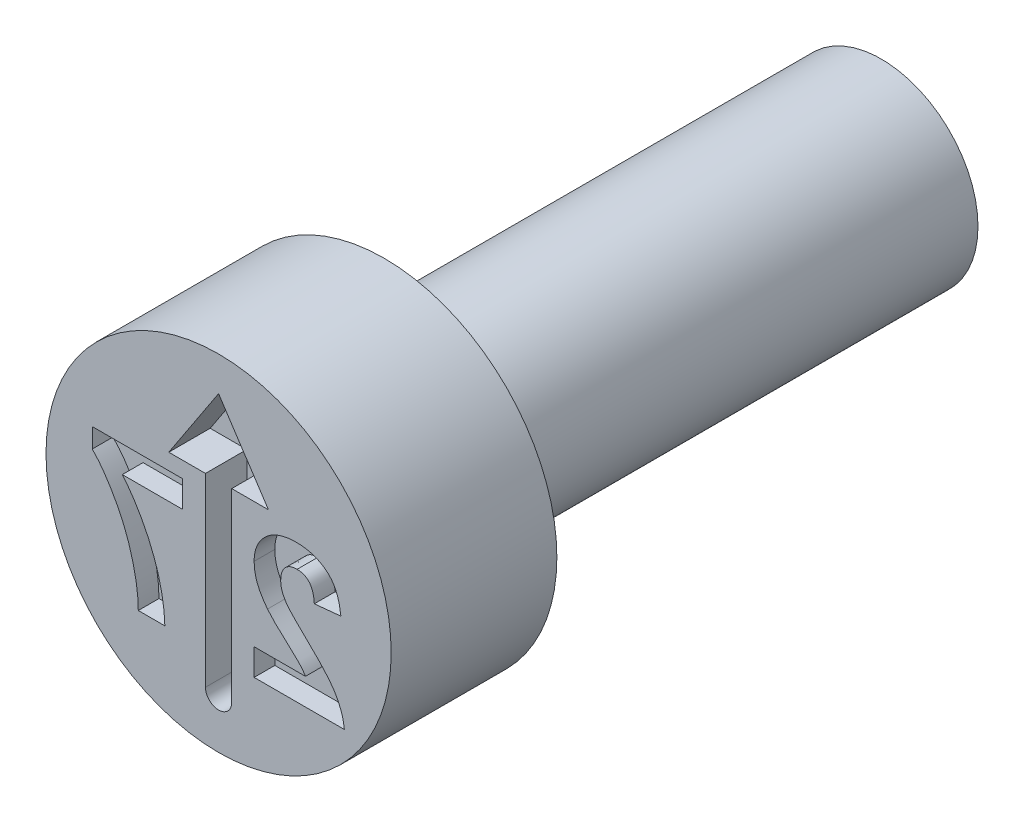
from build123d import *

# Parameters (mm, degrees)
CUT_EXTRUDE4_DEPTH = 0.3
CUT_EXTRUDE5_DEPTH = 0.15


with BuildPart() as part:
    # Sketch2 → Revolve1 (revolve)
    with BuildSketch(Plane(origin=(0, 0, 0), x_dir=(0, 0, -1), z_dir=(1, 0, 0)), mode=Mode.PRIVATE) as revolve1_sk:
        Polygon((0, 1.25), (0, 0), (4.8, 0), (4.8, 0.7), (1.2, 0.7), (1.2, 1.25), align=None)
    revolve(revolve1_sk.sketch.rotate(Axis((0, 0, -0.403888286), (0, 0, -1)), 90), axis=Axis((0, 0, -0.403888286), (0, 0, -1)))

    # Sketch3 → Cut-Extrude4 (cut)
    with BuildSketch(Plane.XY):
        with BuildLine():
            Line((0.095236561, 0.453175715), (0.095236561, -0.888080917))
            ThreePointArc((0.095236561, -0.888080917), (0, -0.983317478), (-0.095236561, -0.888080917))
            Line((-0.095236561, -0.888080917), (-0.095236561, 0.453175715))
            Line((-0.095236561, 0.453175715), (-0.360958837, 0.453175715))
            Line((-0.360958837, 0.453175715), (0, 1.001057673))
            Line((0, 1.001057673), (0.360958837, 0.453175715))
            Line((0.360958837, 0.453175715), (0.095236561, 0.453175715))
        make_face()
    extrude(amount=-CUT_EXTRUDE4_DEPTH, mode=Mode.SUBTRACT)

    # Sketch4 → Cut-Extrude5 (cut)
    with BuildSketch(Plane.XY):
        with BuildLine():
            Line((0.257362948, -0.457692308), (0.257362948, -0.65))
            Line((0.257362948, -0.65), (0.911209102, -0.65))
            add(Edge.make_bspline(
                [(0.911209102, -0.65), (0.908995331, -0.633564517), (0.904569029, -0.600702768), (0.890884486, -0.552700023), (0.872620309, -0.505857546), (0.852798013, -0.46773914), (0.833082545, -0.437055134), (0.815194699, -0.411912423), (0.793855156, -0.385161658), (0.769373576, -0.356586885), (0.741885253, -0.326098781), (0.711185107, -0.293810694), (0.677126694, -0.259877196), (0.653165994, -0.236834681), (0.64077641, -0.224919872)],
                knots=[0, 0, 0, 0, 1.156289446, 2.311930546, 3.473459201, 4.661751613, 5.303057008, 6.018253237, 6.81459331, 7.690699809, 8.644447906, 9.679642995, 10.800191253, 12, 12, 12, 12], degree=3))
            add(Edge.make_bspline(
                [(0.64077641, -0.224919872), (0.63088938, -0.215376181), (0.612067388, -0.197207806), (0.585264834, -0.171191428), (0.561702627, -0.147274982), (0.540888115, -0.126078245), (0.523302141, -0.107061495), (0.508713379, -0.090523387), (0.496937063, -0.076396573), (0.490559, -0.067434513), (0.487731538, -0.063461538)],
                knots=[0, 0, 0, 0, 1.480720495, 2.818855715, 4.024636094, 5.098235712, 6.019786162, 6.815086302, 7.474715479, 8, 8, 8, 8], degree=3))
            add(Edge.make_bspline(
                [(0.487731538, -0.063461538), (0.481941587, -0.053843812), (0.470773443, -0.035292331), (0.458526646, -0.006119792), (0.451175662, 0.023046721), (0.450166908, 0.042535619), (0.449670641, 0.052123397)],
                knots=[0, 0, 0, 0, 1.0911822, 2.104764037, 3.067617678, 4, 4, 4, 4], degree=3))
            add(Edge.make_bspline(
                [(0.449670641, 0.052123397), (0.450030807, 0.06210077), (0.450712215, 0.080977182), (0.456425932, 0.107615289), (0.466558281, 0.130514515), (0.480508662, 0.149745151), (0.498148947, 0.16481228), (0.518770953, 0.175945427), (0.542676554, 0.182100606), (0.55947882, 0.182910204), (0.568260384, 0.183333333)],
                knots=[0, 0, 0, 0, 1.193122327, 2.257294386, 3.237245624, 4.168877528, 5.075331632, 5.990371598, 6.949684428, 8, 8, 8, 8], degree=3))
            add(Edge.make_bspline(
                [(0.568260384, 0.183333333), (0.576982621, 0.182938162), (0.593832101, 0.182174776), (0.617778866, 0.175505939), (0.638727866, 0.163961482), (0.653657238, 0.15080546), (0.663742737, 0.138012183), (0.670614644, 0.126863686), (0.676537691, 0.114195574), (0.681786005, 0.100150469), (0.68593158, 0.08456747), (0.689270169, 0.067565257), (0.691960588, 0.049052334), (0.692816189, 0.036173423), (0.693260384, 0.029487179)],
                knots=[0, 0, 0, 0, 1.402788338, 2.709884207, 3.961032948, 5.225417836, 5.883680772, 6.578928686, 7.329201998, 8.132101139, 8.990263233, 9.922304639, 10.921339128, 12, 12, 12, 12], degree=3))
            Line((0.693260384, 0.029487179), (0.885568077, 0.048317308))
            add(Edge.make_bspline(
                [(0.885568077, 0.048317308), (0.884021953, 0.061300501), (0.881024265, 0.086472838), (0.873543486, 0.122628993), (0.864069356, 0.155984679), (0.852150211, 0.186477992), (0.838278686, 0.214302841), (0.821747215, 0.239041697), (0.803133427, 0.260968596), (0.782421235, 0.280071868), (0.759742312, 0.296412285), (0.735944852, 0.310998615), (0.710563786, 0.322964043), (0.683878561, 0.332825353), (0.655901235, 0.340706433), (0.626502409, 0.345917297), (0.595863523, 0.349582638), (0.574949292, 0.349858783), (0.564253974, 0.35)],
                knots=[0, 0, 0, 0, 1.270971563, 2.464210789, 3.586263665, 4.638946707, 5.643716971, 6.603612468, 7.52484387, 8.434700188, 9.336036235, 10.239171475, 11.145359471, 12.059630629, 13.003312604, 13.96741569, 14.960557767, 16, 16, 16, 16], degree=3))
            add(Edge.make_bspline(
                [(0.564253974, 0.35), (0.552626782, 0.349776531), (0.529981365, 0.349341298), (0.496923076, 0.345747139), (0.465867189, 0.339480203), (0.436542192, 0.331178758), (0.409249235, 0.320095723), (0.383760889, 0.306696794), (0.360478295, 0.290473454), (0.339054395, 0.272310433), (0.319903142, 0.252336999), (0.303128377, 0.231031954), (0.289074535, 0.208410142), (0.277281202, 0.184747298), (0.268524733, 0.159662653), (0.262144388, 0.133503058), (0.257913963, 0.106146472), (0.257548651, 0.087462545), (0.257362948, 0.077964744)],
                knots=[0, 0, 0, 0, 1.210756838, 2.35810096, 3.457354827, 4.507168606, 5.527358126, 6.519769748, 7.499700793, 8.476517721, 9.440526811, 10.376769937, 11.295256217, 12.209626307, 13.124630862, 14.055668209, 15.011616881, 16, 16, 16, 16], degree=3))
            add(Edge.make_bspline(
                [(0.257362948, 0.077964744), (0.257607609, 0.067064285), (0.258092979, 0.045439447), (0.262740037, 0.013471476), (0.269839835, -0.017759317), (0.280332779, -0.048329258), (0.293633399, -0.078971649), (0.310778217, -0.109755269), (0.330684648, -0.141608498), (0.346270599, -0.162203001), (0.354318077, -0.172836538)],
                knots=[0, 0, 0, 0, 0.953409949, 1.89141903, 2.821310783, 3.752688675, 4.715703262, 5.740811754, 6.833515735, 8, 8, 8, 8], degree=3))
            add(Edge.make_bspline(
                [(0.354318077, -0.172836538), (0.35735967, -0.176667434), (0.363874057, -0.184872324), (0.374956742, -0.197453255), (0.387800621, -0.211195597), (0.402224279, -0.226356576), (0.418704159, -0.242399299), (0.436647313, -0.259994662), (0.456843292, -0.278242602), (0.477761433, -0.297598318), (0.498770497, -0.316436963), (0.518080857, -0.3343295), (0.535621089, -0.350160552), (0.550574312, -0.364804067), (0.56382007, -0.377260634), (0.574880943, -0.388169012), (0.583963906, -0.397265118), (0.596479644, -0.41144364), (0.612404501, -0.430620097), (0.623608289, -0.448943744), (0.6289575, -0.457692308)],
                knots=[0, 0, 0, 0, 0.665555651, 1.425465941, 2.280616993, 3.225313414, 4.272635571, 5.410053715, 6.644756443, 7.976022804, 9.288331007, 10.484517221, 11.558462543, 12.503158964, 13.33222979, 14.032602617, 14.617328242, 15.080653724, 16.606167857, 18, 18, 18, 18], degree=3))
            Line((0.6289575, -0.457692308), (0.257362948, -0.457692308))
        make_face()
        with BuildLine():
            Line((-0.26109859, 0.144871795), (-0.26109859, 0.337179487))
            Line((-0.26109859, 0.337179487), (-0.914944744, 0.337179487))
            Line((-0.914944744, 0.337179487), (-0.914944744, 0.196153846))
            add(Edge.make_bspline(
                [(-0.914944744, 0.196153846), (-0.908123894, 0.189213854), (-0.894102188, 0.174947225), (-0.874017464, 0.151598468), (-0.853635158, 0.126260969), (-0.833381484, 0.098593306), (-0.812626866, 0.069032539), (-0.792283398, 0.037012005), (-0.771650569, 0.002947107), (-0.743872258, -0.045237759), (-0.711402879, -0.108182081), (-0.677051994, -0.18642509), (-0.647786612, -0.267071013), (-0.627746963, -0.335787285), (-0.614206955, -0.390863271), (-0.605360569, -0.431136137), (-0.597913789, -0.470275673), (-0.591855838, -0.508350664), (-0.587334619, -0.545378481), (-0.583762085, -0.581230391), (-0.581999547, -0.615993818), (-0.581739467, -0.638780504), (-0.581611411, -0.65)],
                knots=[0, 0, 0, 0, 0.628545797, 1.29210959, 1.98878689, 2.729126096, 3.507039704, 4.322017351, 5.179550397, 6.080149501, 7.915136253, 9.752312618, 11.597470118, 13.454141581, 14.373891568, 15.261584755, 16.117868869, 16.947726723, 17.752002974, 18.527724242, 19.275094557, 20, 20, 20, 20], degree=3))
            Line((-0.581611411, -0.65), (-0.389303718, -0.65))
            add(Edge.make_bspline(
                [(-0.389303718, -0.65), (-0.389946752, -0.632963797), (-0.391239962, -0.598702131), (-0.396078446, -0.547276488), (-0.403677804, -0.495659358), (-0.413116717, -0.443731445), (-0.425578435, -0.391619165), (-0.439801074, -0.339129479), (-0.457029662, -0.286542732), (-0.476342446, -0.233959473), (-0.497662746, -0.181878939), (-0.520898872, -0.130947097), (-0.545990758, -0.081481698), (-0.572612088, -0.033308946), (-0.601072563, 0.013416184), (-0.631393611, 0.058642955), (-0.663145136, 0.102698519), (-0.685847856, 0.130816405), (-0.697196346, 0.144871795)],
                knots=[0, 0, 0, 0, 0.943249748, 1.896978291, 2.856365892, 3.829648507, 4.816416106, 5.820376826, 6.838120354, 7.877341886, 8.919613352, 9.951365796, 10.974227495, 11.988073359, 12.996274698, 14.000568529, 15.000536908, 16, 16, 16, 16], degree=3))
            Line((-0.697196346, 0.144871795), (-0.26109859, 0.144871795))
        make_face()
    extrude(amount=-CUT_EXTRUDE5_DEPTH, mode=Mode.SUBTRACT)


solid = part.part
